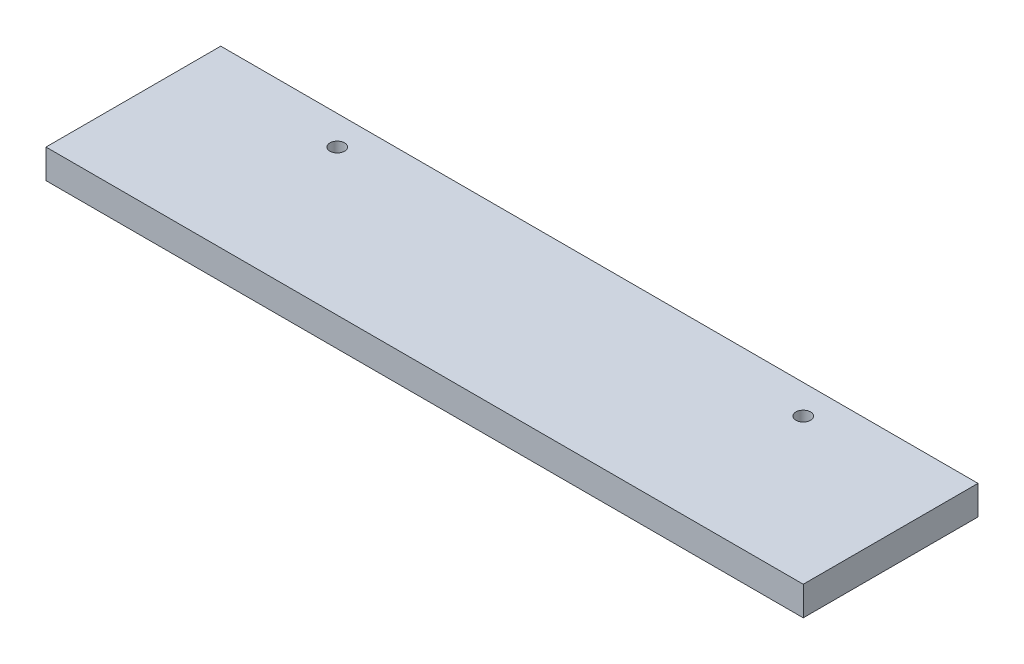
from build123d import *

# Parameters (mm, degrees)
SKETCH1_W           = 82.55
SKETCH1_H           = 19.05
BOSS_EXTRUDE1_DEPTH = 3.175
SKETCH2_R           = 0.79375
CUT_EXTRUDE1_DEPTH  = 85.77904001


with BuildPart() as part:
    # Sketch1 → Boss-Extrude1 (new body)
    with BuildSketch(Plane(origin=(0, 0, 0), x_dir=(1, 0, 0), z_dir=(0, 1, 0))):
        with Locations((41.275, 9.525)):
            Rectangle(SKETCH1_W, SKETCH1_H)
    extrude(amount=BOSS_EXTRUDE1_DEPTH)

    # Sketch2 → Cut-Extrude1 (cut, through all)
    with BuildSketch(Plane(origin=(0, 3.175, 0), x_dir=(1, 0, 0), z_dir=(0, 1, 0))):
        with Locations(Location((15.875, 15.875, 0), (0, 0, 270))):
            Circle(SKETCH2_R)
        with Locations(Location((66.675, 15.875, 0), (0, 0, 270))):
            Circle(SKETCH2_R)
    extrude(amount=-CUT_EXTRUDE1_DEPTH, mode=Mode.SUBTRACT)


solid = part.part
